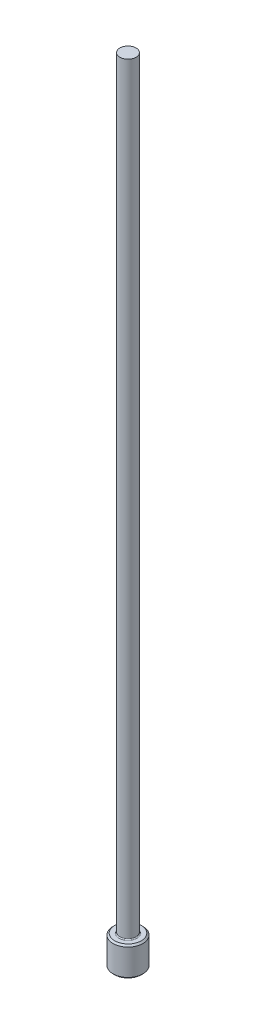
ISO-10303-21;
HEADER;
FILE_DESCRIPTION(('STEP AP214'),'2;1');
FILE_NAME('part.step','',(''),(''),'','','');
FILE_SCHEMA(('AUTOMOTIVE_DESIGN { 1 0 10303 214 1 1 1 1 }'));
ENDSEC;
DATA;
#1=APPLICATION_CONTEXT('core data for automotive mechanical design processes');
#2=APPLICATION_PROTOCOL_DEFINITION('international standard','automotive_design',2000,#1);
#3=PRODUCT_CONTEXT('',#1,'mechanical');
#4=PRODUCT('Part','Part','',(#3));
#5=PRODUCT_RELATED_PRODUCT_CATEGORY('part','',(#4));
#6=PRODUCT_DEFINITION_FORMATION('','',#4);
#7=PRODUCT_DEFINITION_CONTEXT('part definition',#1,'design');
#8=PRODUCT_DEFINITION('design','',#6,#7);
#9=PRODUCT_DEFINITION_SHAPE('','',#8);
#10=(LENGTH_UNIT() NAMED_UNIT(*) SI_UNIT(.MILLI.,.METRE.));
#11=(NAMED_UNIT(*) PLANE_ANGLE_UNIT() SI_UNIT($,.RADIAN.));
#12=(NAMED_UNIT(*) SI_UNIT($,.STERADIAN.) SOLID_ANGLE_UNIT());
#13=UNCERTAINTY_MEASURE_WITH_UNIT(LENGTH_MEASURE(1.E-05),#10,'distance_accuracy_value','');
#14=(GEOMETRIC_REPRESENTATION_CONTEXT(3) GLOBAL_UNCERTAINTY_ASSIGNED_CONTEXT((#13)) GLOBAL_UNIT_ASSIGNED_CONTEXT((#10,
#11,#12)) REPRESENTATION_CONTEXT('',''));
#15=CARTESIAN_POINT('',(0.,0.,0.));
#16=DIRECTION('',(0.,0.,1.));
#17=DIRECTION('',(1.,0.,0.));
#18=AXIS2_PLACEMENT_3D('',#15,#16,#17);
#19=CARTESIAN_POINT('',(0.,0.,0.));
#20=DIRECTION('',(0.,-1.,0.));
#21=DIRECTION('',(0.,0.,-1.));
#22=AXIS2_PLACEMENT_3D('',#19,#20,#21);
#23=PLANE('',#22);
#24=CARTESIAN_POINT('',(0.,0.,0.));
#25=DIRECTION('',(0.,-1.,0.));
#26=DIRECTION('',(0.,0.,-1.));
#27=AXIS2_PLACEMENT_3D('',#24,#25,#26);
#28=CIRCLE('',#27,1.06679999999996);
#29=CARTESIAN_POINT('',(0.,0.,-1.06679999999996));
#30=VERTEX_POINT('',#29);
#31=EDGE_CURVE('E46',#30,#30,#28,.T.);
#32=ORIENTED_EDGE('',*,*,#31,.T.);
#33=EDGE_LOOP('',(#32));
#34=FACE_BOUND('',#33,.T.);
#35=ADVANCED_FACE('F35',(#34),#23,.T.);
#36=CARTESIAN_POINT('',(0.,259.958771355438,0.));
#37=DIRECTION('',(0.,1.,0.));
#38=DIRECTION('',(0.,0.,1.));
#39=AXIS2_PLACEMENT_3D('',#36,#37,#38);
#40=CYLINDRICAL_SURFACE('',#39,1.19379999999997);
#41=CARTESIAN_POINT('',(0.,2.23519999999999,0.));
#42=DIRECTION('',(0.,1.,0.));
#43=DIRECTION('',(0.,0.,1.));
#44=AXIS2_PLACEMENT_3D('',#41,#42,#43);
#45=CIRCLE('',#44,1.19379999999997);
#46=CARTESIAN_POINT('',(0.,2.23519999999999,1.19379999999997));
#47=VERTEX_POINT('',#46);
#48=EDGE_CURVE('E50',#47,#47,#45,.F.);
#49=ORIENTED_EDGE('',*,*,#48,.T.);
#50=EDGE_LOOP('',(#49));
#51=FACE_BOUND('',#50,.T.);
#52=CARTESIAN_POINT('',(0.,0.126999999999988,0.));
#53=DIRECTION('',(0.,-1.,0.));
#54=DIRECTION('',(0.,0.,-1.));
#55=AXIS2_PLACEMENT_3D('',#52,#53,#54);
#56=CIRCLE('',#55,1.19379999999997);
#57=CARTESIAN_POINT('',(0.,0.126999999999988,-1.19379999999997));
#58=VERTEX_POINT('',#57);
#59=EDGE_CURVE('E55',#58,#58,#56,.F.);
#60=ORIENTED_EDGE('',*,*,#59,.T.);
#61=EDGE_LOOP('',(#60));
#62=FACE_BOUND('',#61,.T.);
#63=ADVANCED_FACE('F77',(#51,#62),#40,.T.);
#64=CARTESIAN_POINT('',(-1.19379999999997,2.3622,0.));
#65=DIRECTION('',(0.,1.,0.));
#66=DIRECTION('',(0.,0.,1.));
#67=AXIS2_PLACEMENT_3D('',#64,#65,#66);
#68=PLANE('',#67);
#69=CARTESIAN_POINT('',(0.,2.3622,0.));
#70=DIRECTION('',(0.,1.,0.));
#71=DIRECTION('',(0.,0.,1.));
#72=AXIS2_PLACEMENT_3D('',#69,#70,#71);
#73=CIRCLE('',#72,0.723899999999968);
#74=CARTESIAN_POINT('',(0.,2.3622,0.723899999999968));
#75=VERTEX_POINT('',#74);
#76=EDGE_CURVE('E10',#75,#75,#73,.F.);
#77=ORIENTED_EDGE('',*,*,#76,.T.);
#78=EDGE_LOOP('',(#77));
#79=FACE_BOUND('',#78,.T.);
#80=CARTESIAN_POINT('',(0.,2.3622,0.));
#81=DIRECTION('',(0.,1.,0.));
#82=DIRECTION('',(0.,0.,1.));
#83=AXIS2_PLACEMENT_3D('',#80,#81,#82);
#84=CIRCLE('',#83,1.06679999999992);
#85=CARTESIAN_POINT('',(0.,2.3622,1.06679999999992));
#86=VERTEX_POINT('',#85);
#87=EDGE_CURVE('E58',#86,#86,#84,.T.);
#88=ORIENTED_EDGE('',*,*,#87,.T.);
#89=EDGE_LOOP('',(#88));
#90=FACE_BOUND('',#89,.T.);
#91=ADVANCED_FACE('F69',(#79,#90),#68,.T.);
#92=CARTESIAN_POINT('',(0.,259.958771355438,0.));
#93=DIRECTION('',(0.,1.,0.));
#94=DIRECTION('',(0.,0.,1.));
#95=AXIS2_PLACEMENT_3D('',#92,#93,#94);
#96=CYLINDRICAL_SURFACE('',#95,0.647699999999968);
#97=CARTESIAN_POINT('',(0.,2.43840000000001,0.));
#98=DIRECTION('',(0.,1.,0.));
#99=DIRECTION('',(0.,0.,1.));
#100=AXIS2_PLACEMENT_3D('',#97,#98,#99);
#101=CIRCLE('',#100,0.647699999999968);
#102=CARTESIAN_POINT('',(0.,2.43840000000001,0.647699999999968));
#103=VERTEX_POINT('',#102);
#104=EDGE_CURVE('E42',#103,#103,#101,.T.);
#105=ORIENTED_EDGE('',*,*,#104,.T.);
#106=EDGE_LOOP('',(#105));
#107=FACE_BOUND('',#106,.T.);
#108=CARTESIAN_POINT('',(0.,63.5,0.));
#109=DIRECTION('',(0.,1.,0.));
#110=DIRECTION('',(0.,0.,1.));
#111=AXIS2_PLACEMENT_3D('',#108,#109,#110);
#112=CIRCLE('',#111,0.647699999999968);
#113=CARTESIAN_POINT('',(0.,63.5,0.647699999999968));
#114=VERTEX_POINT('',#113);
#115=EDGE_CURVE('E61',#114,#114,#112,.T.);
#116=ORIENTED_EDGE('',*,*,#115,.F.);
#117=EDGE_LOOP('',(#116));
#118=FACE_BOUND('',#117,.T.);
#119=ADVANCED_FACE('F67',(#107,#118),#96,.T.);
#120=CARTESIAN_POINT('',(-0.647699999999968,63.5,0.));
#121=DIRECTION('',(0.,1.,0.));
#122=DIRECTION('',(0.,0.,1.));
#123=AXIS2_PLACEMENT_3D('',#120,#121,#122);
#124=PLANE('',#123);
#125=ORIENTED_EDGE('',*,*,#115,.T.);
#126=EDGE_LOOP('',(#125));
#127=FACE_BOUND('',#126,.T.);
#128=ADVANCED_FACE('F65',(#127),#124,.T.);
#129=CARTESIAN_POINT('',(0.,2.36219999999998,0.));
#130=DIRECTION('',(0.,-1.,0.));
#131=DIRECTION('',(0.,0.,-1.));
#132=AXIS2_PLACEMENT_3D('',#129,#130,#131);
#133=CONICAL_SURFACE('',#132,1.06679999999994,0.785398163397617);
#134=ORIENTED_EDGE('',*,*,#48,.F.);
#135=EDGE_LOOP('',(#134));
#136=FACE_BOUND('',#135,.T.);
#137=ORIENTED_EDGE('',*,*,#87,.F.);
#138=EDGE_LOOP('',(#137));
#139=FACE_BOUND('',#138,.T.);
#140=ADVANCED_FACE('F75',(#136,#139),#133,.T.);
#141=CARTESIAN_POINT('',(0.,0.126999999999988,0.));
#142=DIRECTION('',(0.,1.,0.));
#143=DIRECTION('',(0.,0.,1.));
#144=AXIS2_PLACEMENT_3D('',#141,#142,#143);
#145=CONICAL_SURFACE('',#144,1.19379999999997,0.785398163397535);
#146=ORIENTED_EDGE('',*,*,#31,.F.);
#147=EDGE_LOOP('',(#146));
#148=FACE_BOUND('',#147,.T.);
#149=ORIENTED_EDGE('',*,*,#59,.F.);
#150=EDGE_LOOP('',(#149));
#151=FACE_BOUND('',#150,.T.);
#152=ADVANCED_FACE('F89',(#148,#151),#145,.T.);
#153=CARTESIAN_POINT('',(0.,2.43840000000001,0.));
#154=DIRECTION('',(0.,1.,0.));
#155=DIRECTION('',(0.,0.,1.));
#156=AXIS2_PLACEMENT_3D('',#153,#154,#155);
#157=TOROIDAL_SURFACE('',#156,0.723899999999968,0.0762);
#158=ORIENTED_EDGE('',*,*,#76,.F.);
#159=EDGE_LOOP('',(#158));
#160=FACE_BOUND('',#159,.T.);
#161=ORIENTED_EDGE('',*,*,#104,.F.);
#162=EDGE_LOOP('',(#161));
#163=FACE_BOUND('',#162,.T.);
#164=ADVANCED_FACE('F37',(#160,#163),#157,.F.);
#165=CLOSED_SHELL('',(#35,#63,#91,#119,#128,#140,#152,#164));
#166=MANIFOLD_SOLID_BREP('B2',#165);
#167=ADVANCED_BREP_SHAPE_REPRESENTATION('',(#18,#166),#14);
#168=SHAPE_DEFINITION_REPRESENTATION(#9,#167);
ENDSEC;
END-ISO-10303-21;
